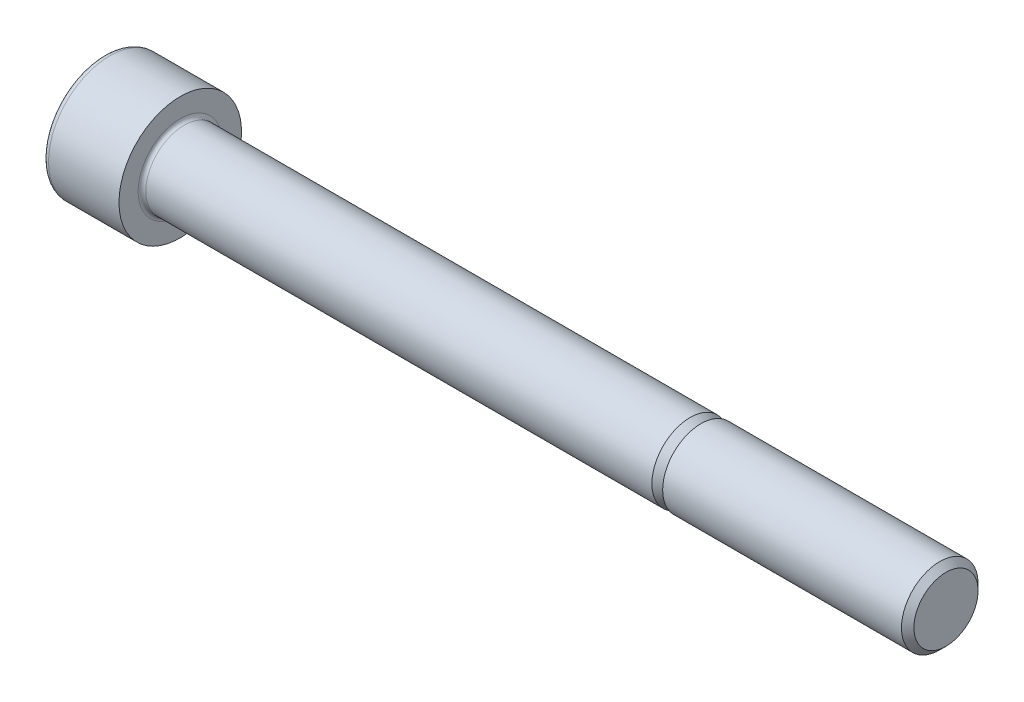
ISO-10303-21;
HEADER;
FILE_DESCRIPTION(('STEP AP214'),'2;1');
FILE_NAME('part.step','',(''),(''),'','','');
FILE_SCHEMA(('AUTOMOTIVE_DESIGN { 1 0 10303 214 1 1 1 1 }'));
ENDSEC;
DATA;
#1=APPLICATION_CONTEXT('core data for automotive mechanical design processes');
#2=APPLICATION_PROTOCOL_DEFINITION('international standard','automotive_design',2000,#1);
#3=PRODUCT_CONTEXT('',#1,'mechanical');
#4=PRODUCT('Part','Part','',(#3));
#5=PRODUCT_RELATED_PRODUCT_CATEGORY('part','',(#4));
#6=PRODUCT_DEFINITION_FORMATION('','',#4);
#7=PRODUCT_DEFINITION_CONTEXT('part definition',#1,'design');
#8=PRODUCT_DEFINITION('design','',#6,#7);
#9=PRODUCT_DEFINITION_SHAPE('','',#8);
#10=(LENGTH_UNIT() NAMED_UNIT(*) SI_UNIT(.MILLI.,.METRE.));
#11=(NAMED_UNIT(*) PLANE_ANGLE_UNIT() SI_UNIT($,.RADIAN.));
#12=(NAMED_UNIT(*) SI_UNIT($,.STERADIAN.) SOLID_ANGLE_UNIT());
#13=UNCERTAINTY_MEASURE_WITH_UNIT(LENGTH_MEASURE(1.E-05),#10,'distance_accuracy_value','');
#14=(GEOMETRIC_REPRESENTATION_CONTEXT(3) GLOBAL_UNCERTAINTY_ASSIGNED_CONTEXT((#13)) GLOBAL_UNIT_ASSIGNED_CONTEXT((#10,
#11,#12)) REPRESENTATION_CONTEXT('',''));
#15=CARTESIAN_POINT('',(0.,0.,0.));
#16=DIRECTION('',(0.,0.,1.));
#17=DIRECTION('',(1.,0.,0.));
#18=AXIS2_PLACEMENT_3D('',#15,#16,#17);
#19=CARTESIAN_POINT('',(-164.,17.,41.));
#20=DIRECTION('',(-1.,0.,0.));
#21=DIRECTION('',(0.,0.,1.));
#22=AXIS2_PLACEMENT_3D('',#19,#20,#21);
#23=PLANE('',#22);
#24=CARTESIAN_POINT('',(-164.,17.,41.));
#25=DIRECTION('',(-1.,0.,0.));
#26=DIRECTION('',(0.,0.,1.));
#27=AXIS2_PLACEMENT_3D('',#24,#25,#26);
#28=CIRCLE('',#27,7.2);
#29=CARTESIAN_POINT('',(-164.,17.,48.2));
#30=VERTEX_POINT('',#29);
#31=EDGE_CURVE('E13',#30,#30,#28,.T.);
#32=ORIENTED_EDGE('',*,*,#31,.T.);
#33=EDGE_LOOP('',(#32));
#34=FACE_BOUND('',#33,.T.);
#35=DIRECTION('',(0.,0.,1.));
#36=VECTOR('',#35,1.);
#37=CARTESIAN_POINT('',(-164.,20.9999981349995,38.6906));
#38=LINE('',#37,#36);
#39=CARTESIAN_POINT('',(-164.,20.9999981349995,38.6906));
#40=VERTEX_POINT('',#39);
#41=CARTESIAN_POINT('',(-164.,20.9999981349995,43.3094));
#42=VERTEX_POINT('',#41);
#43=EDGE_CURVE('E99',#40,#42,#38,.T.);
#44=ORIENTED_EDGE('',*,*,#43,.T.);
#45=DIRECTION('',(0.,-0.866025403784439,0.5));
#46=VECTOR('',#45,1.);
#47=CARTESIAN_POINT('',(-164.,20.9999981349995,43.3094));
#48=LINE('',#47,#46);
#49=CARTESIAN_POINT('',(-164.,17.,45.6188));
#50=VERTEX_POINT('',#49);
#51=EDGE_CURVE('E38',#42,#50,#48,.T.);
#52=ORIENTED_EDGE('',*,*,#51,.T.);
#53=DIRECTION('',(0.,-0.866025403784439,-0.5));
#54=VECTOR('',#53,1.);
#55=CARTESIAN_POINT('',(-164.,17.,45.6188));
#56=LINE('',#55,#54);
#57=CARTESIAN_POINT('',(-164.,13.0000018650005,43.3094));
#58=VERTEX_POINT('',#57);
#59=EDGE_CURVE('E177',#50,#58,#56,.T.);
#60=ORIENTED_EDGE('',*,*,#59,.T.);
#61=DIRECTION('',(0.,0.,-1.));
#62=VECTOR('',#61,1.);
#63=CARTESIAN_POINT('',(-164.,13.0000018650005,43.3094));
#64=LINE('',#63,#62);
#65=CARTESIAN_POINT('',(-164.,13.0000018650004,38.6906));
#66=VERTEX_POINT('',#65);
#67=EDGE_CURVE('E173',#58,#66,#64,.T.);
#68=ORIENTED_EDGE('',*,*,#67,.T.);
#69=DIRECTION('',(0.,0.866025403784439,-0.5));
#70=VECTOR('',#69,1.);
#71=CARTESIAN_POINT('',(-164.,13.0000018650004,38.6906));
#72=LINE('',#71,#70);
#73=CARTESIAN_POINT('',(-164.,17.,36.3812));
#74=VERTEX_POINT('',#73);
#75=EDGE_CURVE('E168',#66,#74,#72,.T.);
#76=ORIENTED_EDGE('',*,*,#75,.T.);
#77=DIRECTION('',(0.,0.866025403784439,0.5));
#78=VECTOR('',#77,1.);
#79=CARTESIAN_POINT('',(-164.,17.,36.3812));
#80=LINE('',#79,#78);
#81=EDGE_CURVE('E103',#74,#40,#80,.T.);
#82=ORIENTED_EDGE('',*,*,#81,.T.);
#83=EDGE_LOOP('',(#44,#52,#60,#68,#76,#82));
#84=FACE_BOUND('',#83,.T.);
#85=ADVANCED_FACE('F24',(#34,#84),#23,.T.);
#86=CARTESIAN_POINT('',(-163.2,17.0000000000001,41.));
#87=DIRECTION('',(-1.,0.,0.));
#88=DIRECTION('',(0.,0.,1.));
#89=AXIS2_PLACEMENT_3D('',#86,#87,#88);
#90=TOROIDAL_SURFACE('',#89,7.2,0.8);
#91=ORIENTED_EDGE('',*,*,#31,.F.);
#92=EDGE_LOOP('',(#91));
#93=FACE_BOUND('',#92,.T.);
#94=CARTESIAN_POINT('',(-163.2,17.0000000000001,41.));
#95=DIRECTION('',(-1.,0.,0.));
#96=DIRECTION('',(0.,0.,1.));
#97=AXIS2_PLACEMENT_3D('',#94,#95,#96);
#98=CIRCLE('',#97,8.);
#99=CARTESIAN_POINT('',(-163.2,17.0000000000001,49.));
#100=VERTEX_POINT('',#99);
#101=EDGE_CURVE('E31',#100,#100,#98,.T.);
#102=ORIENTED_EDGE('',*,*,#101,.T.);
#103=EDGE_LOOP('',(#102));
#104=FACE_BOUND('',#103,.T.);
#105=ADVANCED_FACE('F140',(#93,#104),#90,.T.);
#106=CARTESIAN_POINT('',(-164.,17.,41.));
#107=DIRECTION('',(-1.,0.,0.));
#108=DIRECTION('',(0.,0.,1.));
#109=AXIS2_PLACEMENT_3D('',#106,#107,#108);
#110=CYLINDRICAL_SURFACE('',#109,8.);
#111=CARTESIAN_POINT('',(-154.,17.0000000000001,41.0000000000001));
#112=DIRECTION('',(-1.,0.,0.));
#113=DIRECTION('',(0.,0.,1.));
#114=AXIS2_PLACEMENT_3D('',#111,#112,#113);
#115=CIRCLE('',#114,8.);
#116=CARTESIAN_POINT('',(-154.,17.0000000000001,49.0000000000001));
#117=VERTEX_POINT('',#116);
#118=EDGE_CURVE('E135',#117,#117,#115,.T.);
#119=ORIENTED_EDGE('',*,*,#118,.T.);
#120=EDGE_LOOP('',(#119));
#121=FACE_BOUND('',#120,.T.);
#122=ORIENTED_EDGE('',*,*,#101,.F.);
#123=EDGE_LOOP('',(#122));
#124=FACE_BOUND('',#123,.T.);
#125=ADVANCED_FACE('F142',(#121,#124),#110,.T.);
#126=CARTESIAN_POINT('',(-154.,25.0000000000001,41.));
#127=DIRECTION('',(1.,0.,0.));
#128=DIRECTION('',(0.,0.,-1.));
#129=AXIS2_PLACEMENT_3D('',#126,#127,#128);
#130=PLANE('',#129);
#131=CARTESIAN_POINT('',(-154.,17.0000000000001,41.0000000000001));
#132=DIRECTION('',(-1.,0.,0.));
#133=DIRECTION('',(0.,0.,1.));
#134=AXIS2_PLACEMENT_3D('',#131,#132,#133);
#135=CIRCLE('',#134,5.5);
#136=CARTESIAN_POINT('',(-154.,17.0000000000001,46.5000000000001));
#137=VERTEX_POINT('',#136);
#138=EDGE_CURVE('E132',#137,#137,#135,.T.);
#139=ORIENTED_EDGE('',*,*,#138,.T.);
#140=EDGE_LOOP('',(#139));
#141=FACE_BOUND('',#140,.T.);
#142=ORIENTED_EDGE('',*,*,#118,.F.);
#143=EDGE_LOOP('',(#142));
#144=FACE_BOUND('',#143,.T.);
#145=ADVANCED_FACE('F144',(#141,#144),#130,.T.);
#146=CARTESIAN_POINT('',(-153.5,17.0000000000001,41.0000000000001));
#147=DIRECTION('',(-1.,0.,0.));
#148=DIRECTION('',(0.,0.,1.));
#149=AXIS2_PLACEMENT_3D('',#146,#147,#148);
#150=TOROIDAL_SURFACE('',#149,5.5,0.5);
#151=CARTESIAN_POINT('',(-153.5,17.0000000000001,41.0000000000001));
#152=DIRECTION('',(-1.,0.,0.));
#153=DIRECTION('',(0.,0.,1.));
#154=AXIS2_PLACEMENT_3D('',#151,#152,#153);
#155=CIRCLE('',#154,5.);
#156=CARTESIAN_POINT('',(-153.5,17.0000000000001,46.0000000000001));
#157=VERTEX_POINT('',#156);
#158=EDGE_CURVE('E129',#157,#157,#155,.T.);
#159=ORIENTED_EDGE('',*,*,#158,.T.);
#160=EDGE_LOOP('',(#159));
#161=FACE_BOUND('',#160,.T.);
#162=ORIENTED_EDGE('',*,*,#138,.F.);
#163=EDGE_LOOP('',(#162));
#164=FACE_BOUND('',#163,.T.);
#165=ADVANCED_FACE('F151',(#161,#164),#150,.F.);
#166=CARTESIAN_POINT('',(-164.,17.,41.));
#167=DIRECTION('',(-1.,0.,0.));
#168=DIRECTION('',(0.,0.,1.));
#169=AXIS2_PLACEMENT_3D('',#166,#167,#168);
#170=CYLINDRICAL_SURFACE('',#169,5.);
#171=CARTESIAN_POINT('',(-87.406208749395,17.0000000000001,41.));
#172=DIRECTION('',(-1.,0.,0.));
#173=DIRECTION('',(0.,0.,1.));
#174=AXIS2_PLACEMENT_3D('',#171,#172,#173);
#175=CIRCLE('',#174,5.);
#176=CARTESIAN_POINT('',(-87.406208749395,17.0000000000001,46.));
#177=VERTEX_POINT('',#176);
#178=EDGE_CURVE('E126',#177,#177,#175,.T.);
#179=ORIENTED_EDGE('',*,*,#178,.T.);
#180=EDGE_LOOP('',(#179));
#181=FACE_BOUND('',#180,.T.);
#182=ORIENTED_EDGE('',*,*,#158,.F.);
#183=EDGE_LOOP('',(#182));
#184=FACE_BOUND('',#183,.T.);
#185=ADVANCED_FACE('F278',(#181,#184),#170,.T.);
#186=CARTESIAN_POINT('',(-87.406208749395,17.0000000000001,41.));
#187=DIRECTION('',(-1.,0.,0.));
#188=DIRECTION('',(0.,0.,1.));
#189=AXIS2_PLACEMENT_3D('',#186,#187,#188);
#190=CONICAL_SURFACE('',#189,5.,0.523598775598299);
#191=CARTESIAN_POINT('',(-86.,17.0000000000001,41.));
#192=DIRECTION('',(-1.,0.,0.));
#193=DIRECTION('',(0.,0.,1.));
#194=AXIS2_PLACEMENT_3D('',#191,#192,#193);
#195=CIRCLE('',#194,4.188125);
#196=CARTESIAN_POINT('',(-86.,17.0000000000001,45.188125));
#197=VERTEX_POINT('',#196);
#198=EDGE_CURVE('E123',#197,#197,#195,.T.);
#199=ORIENTED_EDGE('',*,*,#198,.T.);
#200=EDGE_LOOP('',(#199));
#201=FACE_BOUND('',#200,.T.);
#202=ORIENTED_EDGE('',*,*,#178,.F.);
#203=EDGE_LOOP('',(#202));
#204=FACE_BOUND('',#203,.T.);
#205=ADVANCED_FACE('F272',(#201,#204),#190,.T.);
#206=CARTESIAN_POINT('',(-86.,21.188125,41.));
#207=DIRECTION('',(-1.,0.,0.));
#208=DIRECTION('',(0.,0.,1.));
#209=AXIS2_PLACEMENT_3D('',#206,#207,#208);
#210=PLANE('',#209);
#211=CARTESIAN_POINT('',(-86.,17.0000000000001,41.));
#212=DIRECTION('',(-1.,0.,0.));
#213=DIRECTION('',(0.,0.,1.));
#214=AXIS2_PLACEMENT_3D('',#211,#212,#213);
#215=CIRCLE('',#214,5.);
#216=CARTESIAN_POINT('',(-86.,17.0000000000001,46.));
#217=VERTEX_POINT('',#216);
#218=EDGE_CURVE('E120',#217,#217,#215,.T.);
#219=ORIENTED_EDGE('',*,*,#218,.T.);
#220=EDGE_LOOP('',(#219));
#221=FACE_BOUND('',#220,.T.);
#222=ORIENTED_EDGE('',*,*,#198,.F.);
#223=EDGE_LOOP('',(#222));
#224=FACE_BOUND('',#223,.T.);
#225=ADVANCED_FACE('F264',(#221,#224),#210,.T.);
#226=CARTESIAN_POINT('',(-164.,17.,41.));
#227=DIRECTION('',(-1.,0.,0.));
#228=DIRECTION('',(0.,0.,1.));
#229=AXIS2_PLACEMENT_3D('',#226,#227,#228);
#230=CYLINDRICAL_SURFACE('',#229,5.);
#231=CARTESIAN_POINT('',(-54.811875,17.,41.));
#232=DIRECTION('',(-1.,0.,0.));
#233=DIRECTION('',(0.,0.,1.));
#234=AXIS2_PLACEMENT_3D('',#231,#232,#233);
#235=CIRCLE('',#234,5.);
#236=CARTESIAN_POINT('',(-54.811875,17.,46.));
#237=VERTEX_POINT('',#236);
#238=EDGE_CURVE('E117',#237,#237,#235,.T.);
#239=ORIENTED_EDGE('',*,*,#238,.T.);
#240=EDGE_LOOP('',(#239));
#241=FACE_BOUND('',#240,.T.);
#242=ORIENTED_EDGE('',*,*,#218,.F.);
#243=EDGE_LOOP('',(#242));
#244=FACE_BOUND('',#243,.T.);
#245=ADVANCED_FACE('F257',(#241,#244),#230,.T.);
#246=CARTESIAN_POINT('',(-54.811875,17.,41.));
#247=DIRECTION('',(-1.,0.,0.));
#248=DIRECTION('',(0.,0.,1.));
#249=AXIS2_PLACEMENT_3D('',#246,#247,#248);
#250=CONICAL_SURFACE('',#249,5.,0.785398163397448);
#251=CARTESIAN_POINT('',(-54.,17.,41.));
#252=DIRECTION('',(-1.,0.,0.));
#253=DIRECTION('',(0.,0.,1.));
#254=AXIS2_PLACEMENT_3D('',#251,#252,#253);
#255=CIRCLE('',#254,4.188125);
#256=CARTESIAN_POINT('',(-54.,17.,45.188125));
#257=VERTEX_POINT('',#256);
#258=EDGE_CURVE('E114',#257,#257,#255,.T.);
#259=ORIENTED_EDGE('',*,*,#258,.T.);
#260=EDGE_LOOP('',(#259));
#261=FACE_BOUND('',#260,.T.);
#262=ORIENTED_EDGE('',*,*,#238,.F.);
#263=EDGE_LOOP('',(#262));
#264=FACE_BOUND('',#263,.T.);
#265=ADVANCED_FACE('F252',(#261,#264),#250,.T.);
#266=CARTESIAN_POINT('',(-54.,21.188125,41.0000000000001));
#267=DIRECTION('',(1.,0.,0.));
#268=DIRECTION('',(0.,0.,-1.));
#269=AXIS2_PLACEMENT_3D('',#266,#267,#268);
#270=PLANE('',#269);
#271=ORIENTED_EDGE('',*,*,#258,.F.);
#272=EDGE_LOOP('',(#271));
#273=FACE_BOUND('',#272,.T.);
#274=ADVANCED_FACE('F232',(#273),#270,.T.);
#275=CARTESIAN_POINT('',(-156.333334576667,20.9999981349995,43.3094000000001));
#276=DIRECTION('',(0.,-0.5,-0.866025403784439));
#277=DIRECTION('',(0.,0.866025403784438,-0.5));
#278=AXIS2_PLACEMENT_3D('',#275,#276,#277);
#279=PLANE('',#278);
#280=DIRECTION('',(-1.,0.,0.));
#281=VECTOR('',#280,1.);
#282=CARTESIAN_POINT('',(-156.333334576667,17.,45.6188));
#283=LINE('',#282,#281);
#284=CARTESIAN_POINT('',(-159.,17.,45.6188));
#285=VERTEX_POINT('',#284);
#286=EDGE_CURVE('E112',#285,#50,#283,.T.);
#287=ORIENTED_EDGE('',*,*,#286,.T.);
#288=ORIENTED_EDGE('',*,*,#51,.F.);
#289=DIRECTION('',(-1.,0.,0.));
#290=VECTOR('',#289,1.);
#291=CARTESIAN_POINT('',(-156.333334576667,20.9999981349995,43.3094000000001));
#292=LINE('',#291,#290);
#293=CARTESIAN_POINT('',(-159.,20.9999981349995,43.3094000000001));
#294=VERTEX_POINT('',#293);
#295=EDGE_CURVE('E93',#294,#42,#292,.T.);
#296=ORIENTED_EDGE('',*,*,#295,.F.);
#297=CARTESIAN_POINT('',(-159.000000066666,16.9999998,45.6188001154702));
#298=CARTESIAN_POINT('',(-158.94139117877,17.1757754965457,45.5173159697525));
#299=CARTESIAN_POINT('',(-158.888089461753,17.3530684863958,45.414955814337));
#300=CARTESIAN_POINT('',(-158.79505291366,17.710724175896,45.2084632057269));
#301=CARTESIAN_POINT('',(-158.755350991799,17.8910932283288,45.1043270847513));
#302=CARTESIAN_POINT('',(-158.693552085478,18.2495961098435,44.8973453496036));
#303=CARTESIAN_POINT('',(-158.671043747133,18.4276747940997,44.7945315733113));
#304=CARTESIAN_POINT('',(-158.644178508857,18.7846696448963,44.5884205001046));
#305=CARTESIAN_POINT('',(-158.639799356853,18.9635845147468,44.4851239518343));
#306=CARTESIAN_POINT('',(-158.648932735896,19.2978677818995,44.2921254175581));
#307=CARTESIAN_POINT('',(-158.660202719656,19.4532863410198,44.202394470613));
#308=CARTESIAN_POINT('',(-158.695914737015,19.7631109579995,44.0235171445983));
#309=CARTESIAN_POINT('',(-158.720368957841,19.9175159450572,43.9343713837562));
#310=CARTESIAN_POINT('',(-158.78149977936,20.2279788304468,43.7551255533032));
#311=CARTESIAN_POINT('',(-158.81843538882,20.383997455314,43.6650481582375));
#312=CARTESIAN_POINT('',(-158.902263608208,20.6937083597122,43.4862364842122));
#313=CARTESIAN_POINT('',(-158.949136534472,20.8474046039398,43.397499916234));
#314=CARTESIAN_POINT('',(-159.000000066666,20.9999983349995,43.30939988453));
#315=B_SPLINE_CURVE_WITH_KNOTS('',3,(#297,#298,#299,#300,#301,#302,#303,#304,#305,#306,#307,
#308,#309,#310,#311,#312,#313,#314),.UNSPECIFIED.,.F.,.F.,(4,2,2,2,2,2,2,2,4),(0.,
0.634031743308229,1.26958707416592,1.88941437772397,2.50848066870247,3.04741430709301,
3.58684698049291,4.13824168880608,4.68855424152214),.UNSPECIFIED.);
#316=EDGE_CURVE('E86',#285,#294,#315,.T.);
#317=ORIENTED_EDGE('',*,*,#316,.F.);
#318=EDGE_LOOP('',(#287,#288,#296,#317));
#319=FACE_BOUND('',#318,.T.);
#320=ADVANCED_FACE('F94',(#319),#279,.T.);
#321=CARTESIAN_POINT('',(-156.333334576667,17.,45.6188));
#322=DIRECTION('',(0.,0.5,-0.866025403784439));
#323=DIRECTION('',(0.,0.866025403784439,0.5));
#324=AXIS2_PLACEMENT_3D('',#321,#322,#323);
#325=PLANE('',#324);
#326=DIRECTION('',(-1.,0.,0.));
#327=VECTOR('',#326,1.);
#328=CARTESIAN_POINT('',(-156.333334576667,13.0000018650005,43.3094));
#329=LINE('',#328,#327);
#330=CARTESIAN_POINT('',(-159.,13.0000018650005,43.3094));
#331=VERTEX_POINT('',#330);
#332=EDGE_CURVE('E110',#331,#58,#329,.T.);
#333=ORIENTED_EDGE('',*,*,#332,.T.);
#334=ORIENTED_EDGE('',*,*,#59,.F.);
#335=ORIENTED_EDGE('',*,*,#286,.F.);
#336=CARTESIAN_POINT('',(-159.000000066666,13.0000016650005,43.30939988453));
#337=CARTESIAN_POINT('',(-158.94139117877,13.1757773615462,43.4108840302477));
#338=CARTESIAN_POINT('',(-158.888089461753,13.3530703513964,43.5132441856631));
#339=CARTESIAN_POINT('',(-158.79505291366,13.7107260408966,43.7197367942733));
#340=CARTESIAN_POINT('',(-158.7553509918,13.8910950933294,43.8238729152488));
#341=CARTESIAN_POINT('',(-158.693552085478,14.249597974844,44.0308546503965));
#342=CARTESIAN_POINT('',(-158.671043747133,14.4276766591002,44.1336684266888));
#343=CARTESIAN_POINT('',(-158.644178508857,14.7846715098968,44.3397794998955));
#344=CARTESIAN_POINT('',(-158.639799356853,14.9635863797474,44.4430760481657));
#345=CARTESIAN_POINT('',(-158.648932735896,15.2978696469,44.6360745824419));
#346=CARTESIAN_POINT('',(-158.660202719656,15.4532882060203,44.7258055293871));
#347=CARTESIAN_POINT('',(-158.695914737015,15.7631128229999,44.9046828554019));
#348=CARTESIAN_POINT('',(-158.720368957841,15.9175178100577,44.9938286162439));
#349=CARTESIAN_POINT('',(-158.78149977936,16.2279806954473,45.1730744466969));
#350=CARTESIAN_POINT('',(-158.81843538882,16.3839993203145,45.2631518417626));
#351=CARTESIAN_POINT('',(-158.902263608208,16.6937102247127,45.4419635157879));
#352=CARTESIAN_POINT('',(-158.949136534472,16.8474064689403,45.5307000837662));
#353=CARTESIAN_POINT('',(-159.000000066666,17.0000002,45.6188001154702));
#354=B_SPLINE_CURVE_WITH_KNOTS('',3,(#336,#337,#338,#339,#340,#341,#342,#343,#344,#345,#346,
#347,#348,#349,#350,#351,#352,#353),.UNSPECIFIED.,.F.,.F.,(4,2,2,2,2,2,2,2,4),(0.,
0.634031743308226,1.26958707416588,1.88941437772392,2.5084806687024,3.04741430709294,
3.58684698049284,4.13824168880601,4.68855424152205),.UNSPECIFIED.);
#355=EDGE_CURVE('E90',#331,#285,#354,.T.);
#356=ORIENTED_EDGE('',*,*,#355,.F.);
#357=EDGE_LOOP('',(#333,#334,#335,#356));
#358=FACE_BOUND('',#357,.T.);
#359=ADVANCED_FACE('F223',(#358),#325,.T.);
#360=CARTESIAN_POINT('',(-156.333334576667,13.0000018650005,43.3094));
#361=DIRECTION('',(0.,1.,0.));
#362=DIRECTION('',(0.,0.,1.));
#363=AXIS2_PLACEMENT_3D('',#360,#361,#362);
#364=PLANE('',#363);
#365=DIRECTION('',(-1.,0.,0.));
#366=VECTOR('',#365,1.);
#367=CARTESIAN_POINT('',(-156.333334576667,13.0000018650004,38.6906));
#368=LINE('',#367,#366);
#369=CARTESIAN_POINT('',(-159.,13.0000018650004,38.6906));
#370=VERTEX_POINT('',#369);
#371=EDGE_CURVE('E108',#370,#66,#368,.T.);
#372=ORIENTED_EDGE('',*,*,#371,.T.);
#373=ORIENTED_EDGE('',*,*,#67,.F.);
#374=ORIENTED_EDGE('',*,*,#332,.F.);
#375=CARTESIAN_POINT('',(-160.487340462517,13.0000018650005,35.0194223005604));
#376=CARTESIAN_POINT('',(-160.404469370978,13.0000018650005,35.1921559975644));
#377=CARTESIAN_POINT('',(-160.322459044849,13.0000018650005,35.3653104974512));
#378=CARTESIAN_POINT('',(-160.160648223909,13.0000018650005,35.7126853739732));
#379=CARTESIAN_POINT('',(-160.080848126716,13.0000018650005,35.8869059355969));
#380=CARTESIAN_POINT('',(-159.923500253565,13.0000018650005,36.2376361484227));
#381=CARTESIAN_POINT('',(-159.845969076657,13.0000018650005,36.4141532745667));
#382=CARTESIAN_POINT('',(-159.694383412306,13.0000018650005,36.7686687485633));
#383=CARTESIAN_POINT('',(-159.620328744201,13.0000018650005,36.9466670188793));
#384=CARTESIAN_POINT('',(-159.474736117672,13.0000018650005,37.3091167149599));
#385=CARTESIAN_POINT('',(-159.403314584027,13.0000018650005,37.4936151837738));
#386=CARTESIAN_POINT('',(-159.266409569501,13.0000018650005,37.864843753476));
#387=CARTESIAN_POINT('',(-159.200926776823,13.0000018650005,38.0515741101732));
#388=CARTESIAN_POINT('',(-159.07776911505,13.0000018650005,38.4271405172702));
#389=CARTESIAN_POINT('',(-159.02007651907,13.0000018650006,38.6159706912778));
#390=CARTESIAN_POINT('',(-158.914480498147,13.0000018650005,38.9963206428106));
#391=CARTESIAN_POINT('',(-158.866573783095,13.0000018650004,39.1878394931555));
#392=CARTESIAN_POINT('',(-158.783094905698,13.0000018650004,39.5731925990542));
#393=CARTESIAN_POINT('',(-158.747497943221,13.0000018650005,39.7670213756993));
#394=CARTESIAN_POINT('',(-158.690972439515,13.0000018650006,40.1568474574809));
#395=CARTESIAN_POINT('',(-158.670042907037,13.0000018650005,40.352844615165));
#396=CARTESIAN_POINT('',(-158.6447941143,13.0000018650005,40.7435738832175));
#397=CARTESIAN_POINT('',(-158.640278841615,13.0000018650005,40.9382930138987));
#398=CARTESIAN_POINT('',(-158.647737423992,13.0000018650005,41.3274269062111));
#399=CARTESIAN_POINT('',(-158.659712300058,13.0000018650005,41.5218416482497));
#400=CARTESIAN_POINT('',(-158.693919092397,13.0000018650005,41.8584917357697));
#401=CARTESIAN_POINT('',(-158.712657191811,13.0000018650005,42.0010992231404));
#402=CARTESIAN_POINT('',(-158.757716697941,13.0000018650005,42.2851197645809));
#403=CARTESIAN_POINT('',(-158.784039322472,13.0000018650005,42.4265326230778));
#404=CARTESIAN_POINT('',(-158.872983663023,13.0000018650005,42.8488697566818));
#405=CARTESIAN_POINT('',(-158.945561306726,13.0000018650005,43.127712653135));
#406=CARTESIAN_POINT('',(-159.069545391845,13.0000018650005,43.5446328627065));
#407=CARTESIAN_POINT('',(-159.113965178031,13.0000018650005,43.6849083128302));
#408=CARTESIAN_POINT('',(-159.206940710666,13.0000018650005,43.9640950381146));
#409=CARTESIAN_POINT('',(-159.255496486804,13.0000018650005,44.1030063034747));
#410=CARTESIAN_POINT('',(-159.356004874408,13.0000018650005,44.3795201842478));
#411=CARTESIAN_POINT('',(-159.407956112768,13.0000018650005,44.5171233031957));
#412=CARTESIAN_POINT('',(-159.514692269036,13.0000018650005,44.7912204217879));
#413=CARTESIAN_POINT('',(-159.569477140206,13.0000018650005,44.9277144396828));
#414=CARTESIAN_POINT('',(-159.712833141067,13.0000018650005,45.2761317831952));
#415=CARTESIAN_POINT('',(-159.803096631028,13.0000018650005,45.4873578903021));
#416=CARTESIAN_POINT('',(-159.987965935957,13.0000018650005,45.9079070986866));
#417=CARTESIAN_POINT('',(-160.082572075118,13.0000018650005,46.1172300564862));
#418=CARTESIAN_POINT('',(-160.275146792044,13.0000018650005,46.5343799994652));
#419=CARTESIAN_POINT('',(-160.373116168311,13.0000018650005,46.7422066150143));
#420=CARTESIAN_POINT('',(-160.571671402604,13.0000018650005,47.1566081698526));
#421=CARTESIAN_POINT('',(-160.672257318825,13.0000018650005,47.3631830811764));
#422=CARTESIAN_POINT('',(-160.977332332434,13.0000018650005,47.9818721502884));
#423=CARTESIAN_POINT('',(-161.184909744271,13.0000018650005,48.3924620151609));
#424=CARTESIAN_POINT('',(-161.605369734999,13.0000018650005,49.210823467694));
#425=CARTESIAN_POINT('',(-161.818251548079,13.0000018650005,49.6185954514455));
#426=CARTESIAN_POINT('',(-162.227433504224,13.0000018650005,50.3937981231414));
#427=CARTESIAN_POINT('',(-162.423402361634,13.0000018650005,50.7614039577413));
#428=CARTESIAN_POINT('',(-162.817572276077,13.0000018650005,51.4954352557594));
#429=CARTESIAN_POINT('',(-163.015773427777,13.0000018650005,51.8618606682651));
#430=CARTESIAN_POINT('',(-163.413342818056,13.0000018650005,52.5928695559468));
#431=CARTESIAN_POINT('',(-163.61270680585,13.0000018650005,52.9574553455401));
#432=CARTESIAN_POINT('',(-164.012731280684,13.0000018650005,53.6858878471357));
#433=CARTESIAN_POINT('',(-164.213391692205,13.0000018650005,54.0497346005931));
#434=CARTESIAN_POINT('',(-164.414527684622,13.0000018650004,54.4133165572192));
#435=B_SPLINE_CURVE_WITH_KNOTS('',3,(#375,#376,#377,#378,#379,#380,#381,#382,#383,#384,#385,
#386,#387,#388,#389,#390,#391,#392,#393,#394,#395,#396,#397,#398,#399,#400,#401,#402,#403,#404,
#405,#406,#407,#408,#409,#410,#411,#412,#413,#414,#415,#416,#417,#418,#419,#420,#421,#422,#423,
#424,#425,#426,#427,#428,#429,#430,#431,#432,#433,#434),.UNSPECIFIED.,.F.,.F.,(4,2,2,2,2,2,2,2,
2,2,2,2,2,2,2,2,2,2,2,2,2,2,2,2,2,2,2,2,2,4),(0.,0.574761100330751,1.14962493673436,
1.72797591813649,2.30629681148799,2.89973831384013,3.49324849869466,4.08538451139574,
4.67732111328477,5.26805811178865,5.85875518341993,6.44237478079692,7.0260305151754,
7.45731714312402,7.88867305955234,8.75192580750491,9.19331611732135,9.63470959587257,
10.0759256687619,10.517134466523,11.206176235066,11.8952695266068,12.5845275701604,
13.2738009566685,14.6539662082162,16.0339333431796,17.2836591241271,18.5334381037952,
19.7800382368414,21.0265663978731),.UNSPECIFIED.);
#436=EDGE_CURVE('E215',#370,#331,#435,.T.);
#437=ORIENTED_EDGE('',*,*,#436,.F.);
#438=EDGE_LOOP('',(#372,#373,#374,#437));
#439=FACE_BOUND('',#438,.T.);
#440=ADVANCED_FACE('F220',(#439),#364,.T.);
#441=CARTESIAN_POINT('',(-156.333334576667,13.0000018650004,38.6906));
#442=DIRECTION('',(0.,0.5,0.866025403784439));
#443=DIRECTION('',(0.,-0.866025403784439,0.5));
#444=AXIS2_PLACEMENT_3D('',#441,#442,#443);
#445=PLANE('',#444);
#446=DIRECTION('',(-1.,0.,0.));
#447=VECTOR('',#446,1.);
#448=CARTESIAN_POINT('',(-156.333334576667,17.0000000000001,36.3812));
#449=LINE('',#448,#447);
#450=CARTESIAN_POINT('',(-159.,17.0000000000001,36.3812));
#451=VERTEX_POINT('',#450);
#452=EDGE_CURVE('E101',#451,#74,#449,.T.);
#453=ORIENTED_EDGE('',*,*,#452,.T.);
#454=ORIENTED_EDGE('',*,*,#75,.F.);
#455=ORIENTED_EDGE('',*,*,#371,.F.);
#456=CARTESIAN_POINT('',(-159.000000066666,17.0000002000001,36.38119988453));
#457=CARTESIAN_POINT('',(-158.94139117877,16.8242245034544,36.4826840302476));
#458=CARTESIAN_POINT('',(-158.888089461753,16.6469315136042,36.585044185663));
#459=CARTESIAN_POINT('',(-158.79505291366,16.289275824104,36.7915367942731));
#460=CARTESIAN_POINT('',(-158.7553509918,16.1089067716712,36.8956729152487));
#461=CARTESIAN_POINT('',(-158.693552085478,15.7504038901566,37.1026546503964));
#462=CARTESIAN_POINT('',(-158.671043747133,15.5723252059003,37.2054684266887));
#463=CARTESIAN_POINT('',(-158.644178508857,15.2153303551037,37.4115794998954));
#464=CARTESIAN_POINT('',(-158.639799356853,15.0364154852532,37.5148760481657));
#465=CARTESIAN_POINT('',(-158.648932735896,14.7021322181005,37.7078745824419));
#466=CARTESIAN_POINT('',(-158.660202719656,14.5467136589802,37.797605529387));
#467=CARTESIAN_POINT('',(-158.695914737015,14.2368890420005,37.9764828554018));
#468=CARTESIAN_POINT('',(-158.720368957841,14.0824840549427,38.0656286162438));
#469=CARTESIAN_POINT('',(-158.78149977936,13.7720211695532,38.2448744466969));
#470=CARTESIAN_POINT('',(-158.81843538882,13.6160025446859,38.3349518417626));
#471=CARTESIAN_POINT('',(-158.902263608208,13.3062916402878,38.5137635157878));
#472=CARTESIAN_POINT('',(-158.949136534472,13.1525953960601,38.6025000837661));
#473=CARTESIAN_POINT('',(-159.000000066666,13.0000016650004,38.6906001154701));
#474=B_SPLINE_CURVE_WITH_KNOTS('',3,(#456,#457,#458,#459,#460,#461,#462,#463,#464,#465,#466,
#467,#468,#469,#470,#471,#472,#473),.UNSPECIFIED.,.F.,.F.,(4,2,2,2,2,2,2,2,4),(0.,
0.634031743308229,1.26958707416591,1.88941437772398,2.50848066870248,3.04741430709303,
3.58684698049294,4.13824168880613,4.68855424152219),.UNSPECIFIED.);
#475=EDGE_CURVE('E210',#451,#370,#474,.T.);
#476=ORIENTED_EDGE('',*,*,#475,.F.);
#477=EDGE_LOOP('',(#453,#454,#455,#476));
#478=FACE_BOUND('',#477,.T.);
#479=ADVANCED_FACE('F222',(#478),#445,.T.);
#480=CARTESIAN_POINT('',(-156.333334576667,17.0000000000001,36.3812));
#481=DIRECTION('',(0.,-0.5,0.866025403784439));
#482=DIRECTION('',(0.,-0.866025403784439,-0.5));
#483=AXIS2_PLACEMENT_3D('',#480,#481,#482);
#484=PLANE('',#483);
#485=DIRECTION('',(-1.,0.,0.));
#486=VECTOR('',#485,1.);
#487=CARTESIAN_POINT('',(-156.333334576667,20.9999981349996,38.6906000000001));
#488=LINE('',#487,#486);
#489=CARTESIAN_POINT('',(-159.,20.9999981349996,38.6906000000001));
#490=VERTEX_POINT('',#489);
#491=EDGE_CURVE('E98',#490,#40,#488,.T.);
#492=ORIENTED_EDGE('',*,*,#491,.T.);
#493=ORIENTED_EDGE('',*,*,#81,.F.);
#494=ORIENTED_EDGE('',*,*,#452,.F.);
#495=CARTESIAN_POINT('',(-159.000000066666,20.9999983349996,38.6906001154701));
#496=CARTESIAN_POINT('',(-158.94139117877,20.8242226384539,38.5891159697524));
#497=CARTESIAN_POINT('',(-158.888089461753,20.6469296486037,38.486755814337));
#498=CARTESIAN_POINT('',(-158.79505291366,20.2892739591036,38.2802632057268));
#499=CARTESIAN_POINT('',(-158.755350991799,20.1089049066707,38.1761270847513));
#500=CARTESIAN_POINT('',(-158.693552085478,19.7504020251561,37.9691453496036));
#501=CARTESIAN_POINT('',(-158.671043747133,19.5723233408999,37.8663315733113));
#502=CARTESIAN_POINT('',(-158.644178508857,19.2153284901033,37.6602205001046));
#503=CARTESIAN_POINT('',(-158.639799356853,19.0364136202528,37.5569239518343));
#504=CARTESIAN_POINT('',(-158.648932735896,18.7021303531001,37.3639254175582));
#505=CARTESIAN_POINT('',(-158.660202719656,18.5467117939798,37.274194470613));
#506=CARTESIAN_POINT('',(-158.695914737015,18.2368871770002,37.0953171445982));
#507=CARTESIAN_POINT('',(-158.720368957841,18.0824821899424,37.0061713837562));
#508=CARTESIAN_POINT('',(-158.78149977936,17.7720193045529,36.8269255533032));
#509=CARTESIAN_POINT('',(-158.81843538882,17.6160006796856,36.7368481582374));
#510=CARTESIAN_POINT('',(-158.902263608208,17.3062897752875,36.5580364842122));
#511=CARTESIAN_POINT('',(-158.949136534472,17.1525935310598,36.469299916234));
#512=CARTESIAN_POINT('',(-159.000000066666,16.9999998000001,36.38119988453));
#513=B_SPLINE_CURVE_WITH_KNOTS('',3,(#495,#496,#497,#498,#499,#500,#501,#502,#503,#504,#505,
#506,#507,#508,#509,#510,#511,#512),.UNSPECIFIED.,.F.,.F.,(4,2,2,2,2,2,2,2,4),(0.,
0.634031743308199,1.26958707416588,1.88941437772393,2.50848066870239,3.04741430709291,
3.5868469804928,4.13824168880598,4.68855424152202),.UNSPECIFIED.);
#514=EDGE_CURVE('E46',#490,#451,#513,.T.);
#515=ORIENTED_EDGE('',*,*,#514,.F.);
#516=EDGE_LOOP('',(#492,#493,#494,#515));
#517=FACE_BOUND('',#516,.T.);
#518=ADVANCED_FACE('F167',(#517),#484,.T.);
#519=CARTESIAN_POINT('',(-156.333334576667,20.9999981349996,38.6906000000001));
#520=DIRECTION('',(0.,-1.,0.));
#521=DIRECTION('',(0.,0.,-1.));
#522=AXIS2_PLACEMENT_3D('',#519,#520,#521);
#523=PLANE('',#522);
#524=ORIENTED_EDGE('',*,*,#295,.T.);
#525=ORIENTED_EDGE('',*,*,#43,.F.);
#526=ORIENTED_EDGE('',*,*,#491,.F.);
#527=CARTESIAN_POINT('',(-160.487340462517,20.9999981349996,35.0194223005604));
#528=CARTESIAN_POINT('',(-160.404469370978,20.9999981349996,35.1921559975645));
#529=CARTESIAN_POINT('',(-160.322459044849,20.9999981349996,35.3653104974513));
#530=CARTESIAN_POINT('',(-160.160648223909,20.9999981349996,35.7126853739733));
#531=CARTESIAN_POINT('',(-160.080848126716,20.9999981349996,35.8869059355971));
#532=CARTESIAN_POINT('',(-159.923500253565,20.9999981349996,36.2376361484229));
#533=CARTESIAN_POINT('',(-159.845969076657,20.9999981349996,36.4141532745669));
#534=CARTESIAN_POINT('',(-159.694383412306,20.9999981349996,36.7686687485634));
#535=CARTESIAN_POINT('',(-159.620328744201,20.9999981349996,36.9466670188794));
#536=CARTESIAN_POINT('',(-159.474736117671,20.9999981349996,37.3091167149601));
#537=CARTESIAN_POINT('',(-159.403314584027,20.9999981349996,37.4936151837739));
#538=CARTESIAN_POINT('',(-159.266409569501,20.9999981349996,37.8648437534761));
#539=CARTESIAN_POINT('',(-159.200926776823,20.9999981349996,38.0515741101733));
#540=CARTESIAN_POINT('',(-159.07776911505,20.9999981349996,38.4271405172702));
#541=CARTESIAN_POINT('',(-159.02007651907,20.9999981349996,38.6159706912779));
#542=CARTESIAN_POINT('',(-158.914480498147,20.9999981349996,38.9963206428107));
#543=CARTESIAN_POINT('',(-158.866573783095,20.9999981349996,39.1878394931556));
#544=CARTESIAN_POINT('',(-158.783094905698,20.9999981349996,39.5731925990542));
#545=CARTESIAN_POINT('',(-158.747497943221,20.9999981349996,39.7670213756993));
#546=CARTESIAN_POINT('',(-158.690972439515,20.9999981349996,40.1568474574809));
#547=CARTESIAN_POINT('',(-158.670042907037,20.9999981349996,40.352844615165));
#548=CARTESIAN_POINT('',(-158.6447941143,20.9999981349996,40.7435738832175));
#549=CARTESIAN_POINT('',(-158.640278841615,20.9999981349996,40.9382930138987));
#550=CARTESIAN_POINT('',(-158.647737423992,20.9999981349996,41.3274269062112));
#551=CARTESIAN_POINT('',(-158.659712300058,20.9999981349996,41.5218416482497));
#552=CARTESIAN_POINT('',(-158.693919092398,20.9999981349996,41.8584917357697));
#553=CARTESIAN_POINT('',(-158.712657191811,20.9999981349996,42.0010992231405));
#554=CARTESIAN_POINT('',(-158.757716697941,20.9999981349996,42.2851197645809));
#555=CARTESIAN_POINT('',(-158.784039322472,20.9999981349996,42.4265326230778));
#556=CARTESIAN_POINT('',(-158.872983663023,20.9999981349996,42.8488697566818));
#557=CARTESIAN_POINT('',(-158.945561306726,20.9999981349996,43.127712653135));
#558=CARTESIAN_POINT('',(-159.069545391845,20.9999981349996,43.5446328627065));
#559=CARTESIAN_POINT('',(-159.113965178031,20.9999981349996,43.6849083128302));
#560=CARTESIAN_POINT('',(-159.206940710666,20.9999981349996,43.9640950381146));
#561=CARTESIAN_POINT('',(-159.255496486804,20.9999981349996,44.1030063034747));
#562=CARTESIAN_POINT('',(-159.356004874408,20.9999981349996,44.3795201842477));
#563=CARTESIAN_POINT('',(-159.407956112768,20.9999981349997,44.5171233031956));
#564=CARTESIAN_POINT('',(-159.514692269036,20.9999981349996,44.7912204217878));
#565=CARTESIAN_POINT('',(-159.569477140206,20.9999981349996,44.9277144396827));
#566=CARTESIAN_POINT('',(-159.712833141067,20.9999981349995,45.2761317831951));
#567=CARTESIAN_POINT('',(-159.803096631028,20.9999981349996,45.487357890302));
#568=CARTESIAN_POINT('',(-159.987965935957,20.9999981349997,45.9079070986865));
#569=CARTESIAN_POINT('',(-160.082572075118,20.9999981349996,46.1172300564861));
#570=CARTESIAN_POINT('',(-160.275146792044,20.9999981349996,46.534379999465));
#571=CARTESIAN_POINT('',(-160.373116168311,20.9999981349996,46.7422066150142));
#572=CARTESIAN_POINT('',(-160.571671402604,20.9999981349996,47.1566081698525));
#573=CARTESIAN_POINT('',(-160.672257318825,20.9999981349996,47.3631830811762));
#574=CARTESIAN_POINT('',(-160.977332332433,20.9999981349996,47.9818721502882));
#575=CARTESIAN_POINT('',(-161.184909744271,20.9999981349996,48.3924620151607));
#576=CARTESIAN_POINT('',(-161.605369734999,20.9999981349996,49.2108234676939));
#577=CARTESIAN_POINT('',(-161.818251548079,20.9999981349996,49.6185954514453));
#578=CARTESIAN_POINT('',(-162.227433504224,20.9999981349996,50.3937981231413));
#579=CARTESIAN_POINT('',(-162.423402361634,20.9999981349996,50.7614039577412));
#580=CARTESIAN_POINT('',(-162.817572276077,20.9999981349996,51.4954352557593));
#581=CARTESIAN_POINT('',(-163.015773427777,20.9999981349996,51.861860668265));
#582=CARTESIAN_POINT('',(-163.413342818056,20.9999981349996,52.5928695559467));
#583=CARTESIAN_POINT('',(-163.61270680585,20.9999981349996,52.95745534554));
#584=CARTESIAN_POINT('',(-164.012731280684,20.9999981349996,53.6858878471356));
#585=CARTESIAN_POINT('',(-164.213391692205,20.9999981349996,54.0497346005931));
#586=CARTESIAN_POINT('',(-164.414527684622,20.9999981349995,54.4133165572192));
#587=B_SPLINE_CURVE_WITH_KNOTS('',3,(#527,#528,#529,#530,#531,#532,#533,#534,#535,#536,#537,
#538,#539,#540,#541,#542,#543,#544,#545,#546,#547,#548,#549,#550,#551,#552,#553,#554,#555,#556,
#557,#558,#559,#560,#561,#562,#563,#564,#565,#566,#567,#568,#569,#570,#571,#572,#573,#574,#575,
#576,#577,#578,#579,#580,#581,#582,#583,#584,#585,#586),.UNSPECIFIED.,.F.,.F.,(4,2,2,2,2,2,2,2,
2,2,2,2,2,2,2,2,2,2,2,2,2,2,2,2,2,2,2,2,2,4),(0.,0.574761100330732,1.14962493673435,
1.72797591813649,2.30629681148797,2.8997383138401,3.49324849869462,4.08538451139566,
4.67732111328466,5.26805811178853,5.85875518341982,6.44237478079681,7.02603051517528,
7.45731714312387,7.88867305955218,8.75192580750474,9.19331611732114,9.63470959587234,
10.0759256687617,10.5171344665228,11.2061762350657,11.8952695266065,12.5845275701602,
13.2738009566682,14.6539662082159,16.0339333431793,17.2836591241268,18.533438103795,
19.7800382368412,21.0265663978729),.UNSPECIFIED.);
#588=EDGE_CURVE('E87',#294,#490,#587,.F.);
#589=ORIENTED_EDGE('',*,*,#588,.F.);
#590=EDGE_LOOP('',(#524,#525,#526,#589));
#591=FACE_BOUND('',#590,.T.);
#592=ADVANCED_FACE('F82',(#591),#523,.T.);
#593=CARTESIAN_POINT('',(-156.333334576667,17.0000000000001,41.));
#594=DIRECTION('',(-1.,0.,0.));
#595=DIRECTION('',(0.,0.,1.));
#596=AXIS2_PLACEMENT_3D('',#593,#594,#595);
#597=CONICAL_SURFACE('',#596,0.,1.0471975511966);
#598=CARTESIAN_POINT('',(-156.333334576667,17.0000000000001,41.));
#599=VERTEX_POINT('',#598);
#600=VERTEX_LOOP('',#599);
#601=FACE_BOUND('',#600,.T.);
#602=ORIENTED_EDGE('',*,*,#316,.T.);
#603=ORIENTED_EDGE('',*,*,#588,.T.);
#604=ORIENTED_EDGE('',*,*,#514,.T.);
#605=ORIENTED_EDGE('',*,*,#475,.T.);
#606=ORIENTED_EDGE('',*,*,#436,.T.);
#607=ORIENTED_EDGE('',*,*,#355,.T.);
#608=EDGE_LOOP('',(#602,#603,#604,#605,#606,#607));
#609=FACE_BOUND('',#608,.T.);
#610=ADVANCED_FACE('F79',(#601,#609),#597,.F.);
#611=CLOSED_SHELL('',(#85,#105,#125,#145,#165,#185,#205,#225,#245,#265,#274,#320,#359,#440,#479,
#518,#592,#610));
#612=MANIFOLD_SOLID_BREP('B1',#611);
#613=ADVANCED_BREP_SHAPE_REPRESENTATION('',(#18,#612),#14);
#614=SHAPE_DEFINITION_REPRESENTATION(#9,#613);
ENDSEC;
END-ISO-10303-21;
